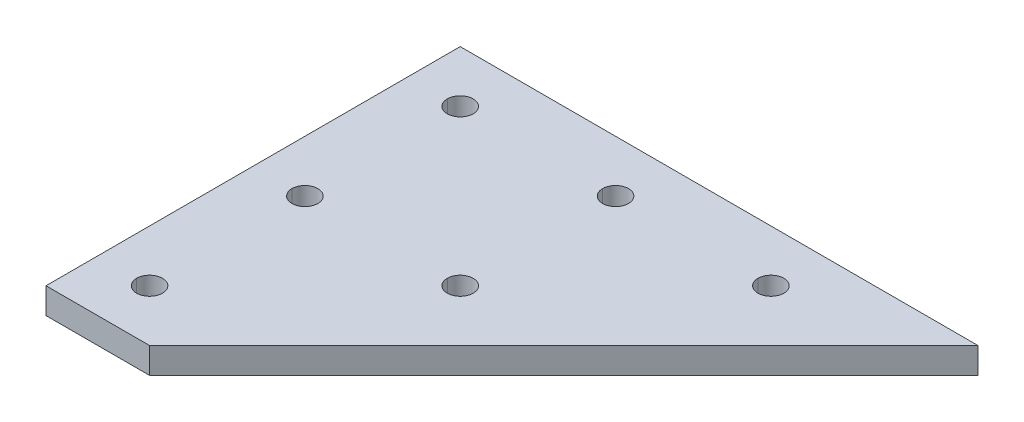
ISO-10303-21;
HEADER;
FILE_DESCRIPTION(('STEP AP214'),'2;1');
FILE_NAME('part.step','',(''),(''),'','','');
FILE_SCHEMA(('AUTOMOTIVE_DESIGN { 1 0 10303 214 1 1 1 1 }'));
ENDSEC;
DATA;
#1=APPLICATION_CONTEXT('core data for automotive mechanical design processes');
#2=APPLICATION_PROTOCOL_DEFINITION('international standard','automotive_design',2000,#1);
#3=PRODUCT_CONTEXT('',#1,'mechanical');
#4=PRODUCT('Part','Part','',(#3));
#5=PRODUCT_RELATED_PRODUCT_CATEGORY('part','',(#4));
#6=PRODUCT_DEFINITION_FORMATION('','',#4);
#7=PRODUCT_DEFINITION_CONTEXT('part definition',#1,'design');
#8=PRODUCT_DEFINITION('design','',#6,#7);
#9=PRODUCT_DEFINITION_SHAPE('','',#8);
#10=(LENGTH_UNIT() NAMED_UNIT(*) SI_UNIT(.MILLI.,.METRE.));
#11=(NAMED_UNIT(*) PLANE_ANGLE_UNIT() SI_UNIT($,.RADIAN.));
#12=(NAMED_UNIT(*) SI_UNIT($,.STERADIAN.) SOLID_ANGLE_UNIT());
#13=UNCERTAINTY_MEASURE_WITH_UNIT(LENGTH_MEASURE(1.E-05),#10,'distance_accuracy_value','');
#14=(GEOMETRIC_REPRESENTATION_CONTEXT(3) GLOBAL_UNCERTAINTY_ASSIGNED_CONTEXT((#13)) GLOBAL_UNIT_ASSIGNED_CONTEXT((#10,
#11,#12)) REPRESENTATION_CONTEXT('',''));
#15=CARTESIAN_POINT('',(0.,0.,0.));
#16=DIRECTION('',(0.,0.,1.));
#17=DIRECTION('',(1.,0.,0.));
#18=AXIS2_PLACEMENT_3D('',#15,#16,#17);
#19=CARTESIAN_POINT('',(-101.6,6.35000000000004,0.));
#20=DIRECTION('',(0.,-1.,0.));
#21=DIRECTION('',(0.,0.,-1.));
#22=AXIS2_PLACEMENT_3D('',#19,#20,#21);
#23=PLANE('',#22);
#24=DIRECTION('',(0.,0.,-1.));
#25=VECTOR('',#24,1.);
#26=CARTESIAN_POINT('',(-127.,6.35000000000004,0.));
#27=LINE('',#26,#25);
#28=CARTESIAN_POINT('',(-127.,6.35000000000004,-101.6));
#29=VERTEX_POINT('',#28);
#30=CARTESIAN_POINT('',(-127.,6.35000000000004,101.6));
#31=VERTEX_POINT('',#30);
#32=EDGE_CURVE('E183',#29,#31,#27,.F.);
#33=ORIENTED_EDGE('',*,*,#32,.T.);
#34=DIRECTION('',(1.,0.,0.));
#35=VECTOR('',#34,1.);
#36=CARTESIAN_POINT('',(-101.6,6.35000000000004,101.6));
#37=LINE('',#36,#35);
#38=CARTESIAN_POINT('',(-76.2,6.35000000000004,101.6));
#39=VERTEX_POINT('',#38);
#40=EDGE_CURVE('E238',#39,#31,#37,.F.);
#41=ORIENTED_EDGE('',*,*,#40,.F.);
#42=DIRECTION('',(-0.707106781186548,0.,0.707106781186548));
#43=VECTOR('',#42,1.);
#44=CARTESIAN_POINT('',(127.,6.35000000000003,-101.6));
#45=LINE('',#44,#43);
#46=CARTESIAN_POINT('',(127.,6.35000000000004,-101.6));
#47=VERTEX_POINT('',#46);
#48=EDGE_CURVE('E243',#39,#47,#45,.F.);
#49=ORIENTED_EDGE('',*,*,#48,.T.);
#50=DIRECTION('',(1.,0.,0.));
#51=VECTOR('',#50,1.);
#52=CARTESIAN_POINT('',(-101.6,6.35000000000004,-101.6));
#53=LINE('',#52,#51);
#54=EDGE_CURVE('E248',#47,#29,#53,.F.);
#55=ORIENTED_EDGE('',*,*,#54,.T.);
#56=EDGE_LOOP('',(#33,#41,#49,#55));
#57=FACE_BOUND('',#56,.T.);
#58=CARTESIAN_POINT('',(-101.6,6.35000000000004,76.2));
#59=DIRECTION('',(0.,-1.,0.));
#60=DIRECTION('',(0.,0.,-1.));
#61=AXIS2_PLACEMENT_3D('',#58,#59,#60);
#62=CIRCLE('',#61,6.35);
#63=CARTESIAN_POINT('',(-95.25,6.35000000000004,76.2));
#64=VERTEX_POINT('',#63);
#65=CARTESIAN_POINT('',(-107.95,6.35000000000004,76.2));
#66=VERTEX_POINT('',#65);
#67=EDGE_CURVE('E189',#64,#66,#62,.T.);
#68=ORIENTED_EDGE('',*,*,#67,.T.);
#69=CARTESIAN_POINT('',(-101.6,6.35000000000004,76.2));
#70=DIRECTION('',(0.,-1.,0.));
#71=DIRECTION('',(0.,0.,-1.));
#72=AXIS2_PLACEMENT_3D('',#69,#70,#71);
#73=CIRCLE('',#72,6.35);
#74=EDGE_CURVE('E184',#66,#64,#73,.T.);
#75=ORIENTED_EDGE('',*,*,#74,.T.);
#76=EDGE_LOOP('',(#68,#75));
#77=FACE_BOUND('',#76,.T.);
#78=CARTESIAN_POINT('',(-101.6,6.35000000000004,0.));
#79=DIRECTION('',(0.,-1.,0.));
#80=DIRECTION('',(0.,0.,-1.));
#81=AXIS2_PLACEMENT_3D('',#78,#79,#80);
#82=CIRCLE('',#81,6.35);
#83=CARTESIAN_POINT('',(-95.25,6.35000000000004,0.));
#84=VERTEX_POINT('',#83);
#85=CARTESIAN_POINT('',(-107.95,6.35000000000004,0.));
#86=VERTEX_POINT('',#85);
#87=EDGE_CURVE('E196',#84,#86,#82,.T.);
#88=ORIENTED_EDGE('',*,*,#87,.T.);
#89=CARTESIAN_POINT('',(-101.6,6.35000000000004,0.));
#90=DIRECTION('',(0.,-1.,0.));
#91=DIRECTION('',(0.,0.,-1.));
#92=AXIS2_PLACEMENT_3D('',#89,#90,#91);
#93=CIRCLE('',#92,6.35);
#94=EDGE_CURVE('E192',#86,#84,#93,.T.);
#95=ORIENTED_EDGE('',*,*,#94,.T.);
#96=EDGE_LOOP('',(#88,#95));
#97=FACE_BOUND('',#96,.T.);
#98=CARTESIAN_POINT('',(-101.6,6.35000000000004,-76.2));
#99=DIRECTION('',(0.,-1.,0.));
#100=DIRECTION('',(0.,0.,-1.));
#101=AXIS2_PLACEMENT_3D('',#98,#99,#100);
#102=CIRCLE('',#101,6.35);
#103=CARTESIAN_POINT('',(-95.25,6.35000000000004,-76.2));
#104=VERTEX_POINT('',#103);
#105=CARTESIAN_POINT('',(-107.95,6.35000000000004,-76.1999999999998));
#106=VERTEX_POINT('',#105);
#107=EDGE_CURVE('E203',#104,#106,#102,.T.);
#108=ORIENTED_EDGE('',*,*,#107,.T.);
#109=CARTESIAN_POINT('',(-101.6,6.35000000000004,-76.2));
#110=DIRECTION('',(0.,-1.,0.));
#111=DIRECTION('',(0.,0.,-1.));
#112=AXIS2_PLACEMENT_3D('',#109,#110,#111);
#113=CIRCLE('',#112,6.35);
#114=EDGE_CURVE('E199',#106,#104,#113,.T.);
#115=ORIENTED_EDGE('',*,*,#114,.T.);
#116=EDGE_LOOP('',(#108,#115));
#117=FACE_BOUND('',#116,.T.);
#118=CARTESIAN_POINT('',(50.8,6.35000000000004,-76.2));
#119=DIRECTION('',(0.,-1.,0.));
#120=DIRECTION('',(0.,0.,-1.));
#121=AXIS2_PLACEMENT_3D('',#118,#119,#120);
#122=CIRCLE('',#121,6.34999999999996);
#123=CARTESIAN_POINT('',(57.15,6.35000000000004,-76.2));
#124=VERTEX_POINT('',#123);
#125=CARTESIAN_POINT('',(44.45,6.35000000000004,-76.1999999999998));
#126=VERTEX_POINT('',#125);
#127=EDGE_CURVE('E210',#124,#126,#122,.T.);
#128=ORIENTED_EDGE('',*,*,#127,.T.);
#129=CARTESIAN_POINT('',(50.8,6.35000000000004,-76.2));
#130=DIRECTION('',(0.,-1.,0.));
#131=DIRECTION('',(0.,0.,-1.));
#132=AXIS2_PLACEMENT_3D('',#129,#130,#131);
#133=CIRCLE('',#132,6.34999999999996);
#134=EDGE_CURVE('E206',#126,#124,#133,.T.);
#135=ORIENTED_EDGE('',*,*,#134,.T.);
#136=EDGE_LOOP('',(#128,#135));
#137=FACE_BOUND('',#136,.T.);
#138=CARTESIAN_POINT('',(-25.4,6.35000000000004,-76.2));
#139=DIRECTION('',(0.,1.,0.));
#140=DIRECTION('',(0.,0.,1.));
#141=AXIS2_PLACEMENT_3D('',#138,#139,#140);
#142=CIRCLE('',#141,6.35);
#143=CARTESIAN_POINT('',(-31.75,6.35000000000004,-76.2));
#144=VERTEX_POINT('',#143);
#145=CARTESIAN_POINT('',(-19.05,6.35000000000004,-76.2));
#146=VERTEX_POINT('',#145);
#147=EDGE_CURVE('E144',#144,#146,#142,.F.);
#148=ORIENTED_EDGE('',*,*,#147,.T.);
#149=CARTESIAN_POINT('',(-25.4,6.35000000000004,-76.2));
#150=DIRECTION('',(0.,1.,0.));
#151=DIRECTION('',(0.,0.,1.));
#152=AXIS2_PLACEMENT_3D('',#149,#150,#151);
#153=CIRCLE('',#152,6.35);
#154=EDGE_CURVE('E141',#146,#144,#153,.F.);
#155=ORIENTED_EDGE('',*,*,#154,.T.);
#156=EDGE_LOOP('',(#148,#155));
#157=FACE_BOUND('',#156,.T.);
#158=CARTESIAN_POINT('',(-25.4,6.35000000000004,0.));
#159=DIRECTION('',(0.,1.,0.));
#160=DIRECTION('',(0.,0.,1.));
#161=AXIS2_PLACEMENT_3D('',#158,#159,#160);
#162=CIRCLE('',#161,6.35);
#163=CARTESIAN_POINT('',(-31.75,6.35000000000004,0.));
#164=VERTEX_POINT('',#163);
#165=CARTESIAN_POINT('',(-19.05,6.35000000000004,0.));
#166=VERTEX_POINT('',#165);
#167=EDGE_CURVE('E131',#164,#166,#162,.F.);
#168=ORIENTED_EDGE('',*,*,#167,.T.);
#169=CARTESIAN_POINT('',(-25.4,6.35000000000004,0.));
#170=DIRECTION('',(0.,1.,0.));
#171=DIRECTION('',(0.,0.,1.));
#172=AXIS2_PLACEMENT_3D('',#169,#170,#171);
#173=CIRCLE('',#172,6.35);
#174=EDGE_CURVE('E19',#166,#164,#173,.F.);
#175=ORIENTED_EDGE('',*,*,#174,.T.);
#176=EDGE_LOOP('',(#168,#175));
#177=FACE_BOUND('',#176,.T.);
#178=ADVANCED_FACE('F16',(#57,#77,#97,#117,#137,#157,#177),#23,.F.);
#179=CARTESIAN_POINT('',(-25.4,0.,0.));
#180=DIRECTION('',(0.,1.,0.));
#181=DIRECTION('',(0.,0.,1.));
#182=AXIS2_PLACEMENT_3D('',#179,#180,#181);
#183=CYLINDRICAL_SURFACE('',#182,6.35);
#184=ORIENTED_EDGE('',*,*,#174,.F.);
#185=DIRECTION('',(0.,1.,0.));
#186=VECTOR('',#185,1.);
#187=CARTESIAN_POINT('',(-19.05,0.,0.));
#188=LINE('',#187,#186);
#189=CARTESIAN_POINT('',(-19.05,-6.35000000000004,0.));
#190=VERTEX_POINT('',#189);
#191=EDGE_CURVE('E136',#166,#190,#188,.F.);
#192=ORIENTED_EDGE('',*,*,#191,.T.);
#193=CARTESIAN_POINT('',(-25.4,-6.35000000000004,0.));
#194=DIRECTION('',(0.,1.,0.));
#195=DIRECTION('',(0.,0.,1.));
#196=AXIS2_PLACEMENT_3D('',#193,#194,#195);
#197=CIRCLE('',#196,6.35);
#198=CARTESIAN_POINT('',(-31.75,-6.35000000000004,0.));
#199=VERTEX_POINT('',#198);
#200=EDGE_CURVE('E140',#190,#199,#197,.F.);
#201=ORIENTED_EDGE('',*,*,#200,.T.);
#202=DIRECTION('',(0.,1.,0.));
#203=VECTOR('',#202,1.);
#204=CARTESIAN_POINT('',(-31.75,0.,0.));
#205=LINE('',#204,#203);
#206=EDGE_CURVE('E134',#199,#164,#205,.T.);
#207=ORIENTED_EDGE('',*,*,#206,.T.);
#208=EDGE_LOOP('',(#184,#192,#201,#207));
#209=FACE_BOUND('',#208,.T.);
#210=ADVANCED_FACE('F139',(#209),#183,.F.);
#211=CARTESIAN_POINT('',(-25.4,0.,0.));
#212=DIRECTION('',(0.,1.,0.));
#213=DIRECTION('',(0.,0.,1.));
#214=AXIS2_PLACEMENT_3D('',#211,#212,#213);
#215=CYLINDRICAL_SURFACE('',#214,6.35);
#216=CARTESIAN_POINT('',(-25.4,-6.35000000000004,0.));
#217=DIRECTION('',(0.,1.,0.));
#218=DIRECTION('',(0.,0.,1.));
#219=AXIS2_PLACEMENT_3D('',#216,#217,#218);
#220=CIRCLE('',#219,6.35);
#221=EDGE_CURVE('E180',#199,#190,#220,.F.);
#222=ORIENTED_EDGE('',*,*,#221,.T.);
#223=ORIENTED_EDGE('',*,*,#191,.F.);
#224=ORIENTED_EDGE('',*,*,#167,.F.);
#225=ORIENTED_EDGE('',*,*,#206,.F.);
#226=EDGE_LOOP('',(#222,#223,#224,#225));
#227=FACE_BOUND('',#226,.T.);
#228=ADVANCED_FACE('F133',(#227),#215,.F.);
#229=CARTESIAN_POINT('',(-25.4,0.,-76.2));
#230=DIRECTION('',(0.,1.,0.));
#231=DIRECTION('',(0.,0.,1.));
#232=AXIS2_PLACEMENT_3D('',#229,#230,#231);
#233=CYLINDRICAL_SURFACE('',#232,6.35);
#234=ORIENTED_EDGE('',*,*,#154,.F.);
#235=DIRECTION('',(0.,1.,0.));
#236=VECTOR('',#235,1.);
#237=CARTESIAN_POINT('',(-19.05,0.,-76.2));
#238=LINE('',#237,#236);
#239=CARTESIAN_POINT('',(-19.05,-6.35000000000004,-76.2));
#240=VERTEX_POINT('',#239);
#241=EDGE_CURVE('E214',#146,#240,#238,.F.);
#242=ORIENTED_EDGE('',*,*,#241,.T.);
#243=CARTESIAN_POINT('',(-25.4,-6.35000000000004,-76.2));
#244=DIRECTION('',(0.,1.,0.));
#245=DIRECTION('',(0.,0.,1.));
#246=AXIS2_PLACEMENT_3D('',#243,#244,#245);
#247=CIRCLE('',#246,6.35);
#248=CARTESIAN_POINT('',(-31.75,-6.35000000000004,-76.2));
#249=VERTEX_POINT('',#248);
#250=EDGE_CURVE('E177',#240,#249,#247,.F.);
#251=ORIENTED_EDGE('',*,*,#250,.T.);
#252=DIRECTION('',(0.,1.,0.));
#253=VECTOR('',#252,1.);
#254=CARTESIAN_POINT('',(-31.75,0.,-76.2));
#255=LINE('',#254,#253);
#256=EDGE_CURVE('E212',#249,#144,#255,.T.);
#257=ORIENTED_EDGE('',*,*,#256,.T.);
#258=EDGE_LOOP('',(#234,#242,#251,#257));
#259=FACE_BOUND('',#258,.T.);
#260=ADVANCED_FACE('F329',(#259),#233,.F.);
#261=CARTESIAN_POINT('',(-25.4,0.,-76.2));
#262=DIRECTION('',(0.,1.,0.));
#263=DIRECTION('',(0.,0.,1.));
#264=AXIS2_PLACEMENT_3D('',#261,#262,#263);
#265=CYLINDRICAL_SURFACE('',#264,6.35);
#266=CARTESIAN_POINT('',(-25.4,-6.35000000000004,-76.2));
#267=DIRECTION('',(0.,1.,0.));
#268=DIRECTION('',(0.,0.,1.));
#269=AXIS2_PLACEMENT_3D('',#266,#267,#268);
#270=CIRCLE('',#269,6.35);
#271=EDGE_CURVE('E174',#249,#240,#270,.F.);
#272=ORIENTED_EDGE('',*,*,#271,.T.);
#273=ORIENTED_EDGE('',*,*,#241,.F.);
#274=ORIENTED_EDGE('',*,*,#147,.F.);
#275=ORIENTED_EDGE('',*,*,#256,.F.);
#276=EDGE_LOOP('',(#272,#273,#274,#275));
#277=FACE_BOUND('',#276,.T.);
#278=ADVANCED_FACE('F325',(#277),#265,.F.);
#279=CARTESIAN_POINT('',(50.8,31.75,-76.2));
#280=DIRECTION('',(0.,-1.,0.));
#281=DIRECTION('',(0.,0.,-1.));
#282=AXIS2_PLACEMENT_3D('',#279,#280,#281);
#283=CYLINDRICAL_SURFACE('',#282,6.34999999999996);
#284=CARTESIAN_POINT('',(50.8,-6.35000000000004,-76.2));
#285=DIRECTION('',(0.,-1.,0.));
#286=DIRECTION('',(0.,0.,-1.));
#287=AXIS2_PLACEMENT_3D('',#284,#285,#286);
#288=CIRCLE('',#287,6.34999999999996);
#289=CARTESIAN_POINT('',(57.15,-6.35000000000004,-76.2));
#290=VERTEX_POINT('',#289);
#291=CARTESIAN_POINT('',(44.45,-6.35000000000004,-76.2));
#292=VERTEX_POINT('',#291);
#293=EDGE_CURVE('E171',#290,#292,#288,.T.);
#294=ORIENTED_EDGE('',*,*,#293,.T.);
#295=DIRECTION('',(0.,-1.,0.));
#296=VECTOR('',#295,1.);
#297=CARTESIAN_POINT('',(44.45,31.75,-76.2));
#298=LINE('',#297,#296);
#299=EDGE_CURVE('E209',#292,#126,#298,.F.);
#300=ORIENTED_EDGE('',*,*,#299,.T.);
#301=ORIENTED_EDGE('',*,*,#127,.F.);
#302=DIRECTION('',(0.,-1.,0.));
#303=VECTOR('',#302,1.);
#304=CARTESIAN_POINT('',(57.15,31.75,-76.2));
#305=LINE('',#304,#303);
#306=EDGE_CURVE('E205',#124,#290,#305,.T.);
#307=ORIENTED_EDGE('',*,*,#306,.T.);
#308=EDGE_LOOP('',(#294,#300,#301,#307));
#309=FACE_BOUND('',#308,.T.);
#310=ADVANCED_FACE('F321',(#309),#283,.F.);
#311=CARTESIAN_POINT('',(50.8,31.75,-76.2));
#312=DIRECTION('',(0.,-1.,0.));
#313=DIRECTION('',(0.,0.,-1.));
#314=AXIS2_PLACEMENT_3D('',#311,#312,#313);
#315=CYLINDRICAL_SURFACE('',#314,6.34999999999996);
#316=ORIENTED_EDGE('',*,*,#134,.F.);
#317=ORIENTED_EDGE('',*,*,#299,.F.);
#318=CARTESIAN_POINT('',(50.8,-6.35000000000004,-76.2));
#319=DIRECTION('',(0.,-1.,0.));
#320=DIRECTION('',(0.,0.,-1.));
#321=AXIS2_PLACEMENT_3D('',#318,#319,#320);
#322=CIRCLE('',#321,6.34999999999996);
#323=EDGE_CURVE('E168',#292,#290,#322,.T.);
#324=ORIENTED_EDGE('',*,*,#323,.T.);
#325=ORIENTED_EDGE('',*,*,#306,.F.);
#326=EDGE_LOOP('',(#316,#317,#324,#325));
#327=FACE_BOUND('',#326,.T.);
#328=ADVANCED_FACE('F317',(#327),#315,.F.);
#329=CARTESIAN_POINT('',(-101.6,6.35000000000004,-76.2));
#330=DIRECTION('',(0.,-1.,0.));
#331=DIRECTION('',(0.,0.,-1.));
#332=AXIS2_PLACEMENT_3D('',#329,#330,#331);
#333=CYLINDRICAL_SURFACE('',#332,6.35);
#334=CARTESIAN_POINT('',(-101.6,-6.35000000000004,-76.2));
#335=DIRECTION('',(0.,-1.,0.));
#336=DIRECTION('',(0.,0.,-1.));
#337=AXIS2_PLACEMENT_3D('',#334,#335,#336);
#338=CIRCLE('',#337,6.35);
#339=CARTESIAN_POINT('',(-95.25,-6.35000000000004,-76.2));
#340=VERTEX_POINT('',#339);
#341=CARTESIAN_POINT('',(-107.95,-6.35000000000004,-76.2));
#342=VERTEX_POINT('',#341);
#343=EDGE_CURVE('E165',#340,#342,#338,.T.);
#344=ORIENTED_EDGE('',*,*,#343,.T.);
#345=DIRECTION('',(0.,-1.,0.));
#346=VECTOR('',#345,1.);
#347=CARTESIAN_POINT('',(-107.95,6.35000000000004,-76.2));
#348=LINE('',#347,#346);
#349=EDGE_CURVE('E202',#342,#106,#348,.F.);
#350=ORIENTED_EDGE('',*,*,#349,.T.);
#351=ORIENTED_EDGE('',*,*,#107,.F.);
#352=DIRECTION('',(0.,-1.,0.));
#353=VECTOR('',#352,1.);
#354=CARTESIAN_POINT('',(-95.25,6.35000000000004,-76.2));
#355=LINE('',#354,#353);
#356=EDGE_CURVE('E198',#104,#340,#355,.T.);
#357=ORIENTED_EDGE('',*,*,#356,.T.);
#358=EDGE_LOOP('',(#344,#350,#351,#357));
#359=FACE_BOUND('',#358,.T.);
#360=ADVANCED_FACE('F313',(#359),#333,.F.);
#361=CARTESIAN_POINT('',(-101.6,6.35000000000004,-76.2));
#362=DIRECTION('',(0.,-1.,0.));
#363=DIRECTION('',(0.,0.,-1.));
#364=AXIS2_PLACEMENT_3D('',#361,#362,#363);
#365=CYLINDRICAL_SURFACE('',#364,6.35);
#366=ORIENTED_EDGE('',*,*,#114,.F.);
#367=ORIENTED_EDGE('',*,*,#349,.F.);
#368=CARTESIAN_POINT('',(-101.6,-6.35000000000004,-76.2));
#369=DIRECTION('',(0.,-1.,0.));
#370=DIRECTION('',(0.,0.,-1.));
#371=AXIS2_PLACEMENT_3D('',#368,#369,#370);
#372=CIRCLE('',#371,6.35);
#373=EDGE_CURVE('E162',#342,#340,#372,.T.);
#374=ORIENTED_EDGE('',*,*,#373,.T.);
#375=ORIENTED_EDGE('',*,*,#356,.F.);
#376=EDGE_LOOP('',(#366,#367,#374,#375));
#377=FACE_BOUND('',#376,.T.);
#378=ADVANCED_FACE('F309',(#377),#365,.F.);
#379=CARTESIAN_POINT('',(-101.6,6.35000000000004,0.));
#380=DIRECTION('',(0.,-1.,0.));
#381=DIRECTION('',(0.,0.,-1.));
#382=AXIS2_PLACEMENT_3D('',#379,#380,#381);
#383=CYLINDRICAL_SURFACE('',#382,6.35);
#384=CARTESIAN_POINT('',(-101.6,-6.35000000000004,0.));
#385=DIRECTION('',(0.,-1.,0.));
#386=DIRECTION('',(0.,0.,-1.));
#387=AXIS2_PLACEMENT_3D('',#384,#385,#386);
#388=CIRCLE('',#387,6.35);
#389=CARTESIAN_POINT('',(-95.25,-6.35000000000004,0.));
#390=VERTEX_POINT('',#389);
#391=CARTESIAN_POINT('',(-107.95,-6.35000000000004,0.));
#392=VERTEX_POINT('',#391);
#393=EDGE_CURVE('E159',#390,#392,#388,.T.);
#394=ORIENTED_EDGE('',*,*,#393,.T.);
#395=DIRECTION('',(0.,-1.,0.));
#396=VECTOR('',#395,1.);
#397=CARTESIAN_POINT('',(-107.95,6.35000000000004,0.));
#398=LINE('',#397,#396);
#399=EDGE_CURVE('E195',#392,#86,#398,.F.);
#400=ORIENTED_EDGE('',*,*,#399,.T.);
#401=ORIENTED_EDGE('',*,*,#87,.F.);
#402=DIRECTION('',(0.,-1.,0.));
#403=VECTOR('',#402,1.);
#404=CARTESIAN_POINT('',(-95.25,6.35000000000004,0.));
#405=LINE('',#404,#403);
#406=EDGE_CURVE('E191',#84,#390,#405,.T.);
#407=ORIENTED_EDGE('',*,*,#406,.T.);
#408=EDGE_LOOP('',(#394,#400,#401,#407));
#409=FACE_BOUND('',#408,.T.);
#410=ADVANCED_FACE('F305',(#409),#383,.F.);
#411=CARTESIAN_POINT('',(-101.6,6.35000000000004,0.));
#412=DIRECTION('',(0.,-1.,0.));
#413=DIRECTION('',(0.,0.,-1.));
#414=AXIS2_PLACEMENT_3D('',#411,#412,#413);
#415=CYLINDRICAL_SURFACE('',#414,6.35);
#416=ORIENTED_EDGE('',*,*,#94,.F.);
#417=ORIENTED_EDGE('',*,*,#399,.F.);
#418=CARTESIAN_POINT('',(-101.6,-6.35000000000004,0.));
#419=DIRECTION('',(0.,-1.,0.));
#420=DIRECTION('',(0.,0.,-1.));
#421=AXIS2_PLACEMENT_3D('',#418,#419,#420);
#422=CIRCLE('',#421,6.35);
#423=EDGE_CURVE('E156',#392,#390,#422,.T.);
#424=ORIENTED_EDGE('',*,*,#423,.T.);
#425=ORIENTED_EDGE('',*,*,#406,.F.);
#426=EDGE_LOOP('',(#416,#417,#424,#425));
#427=FACE_BOUND('',#426,.T.);
#428=ADVANCED_FACE('F301',(#427),#415,.F.);
#429=CARTESIAN_POINT('',(-101.6,6.35000000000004,76.2));
#430=DIRECTION('',(0.,-1.,0.));
#431=DIRECTION('',(0.,0.,-1.));
#432=AXIS2_PLACEMENT_3D('',#429,#430,#431);
#433=CYLINDRICAL_SURFACE('',#432,6.35);
#434=CARTESIAN_POINT('',(-101.6,-6.35000000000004,76.2));
#435=DIRECTION('',(0.,-1.,0.));
#436=DIRECTION('',(0.,0.,-1.));
#437=AXIS2_PLACEMENT_3D('',#434,#435,#436);
#438=CIRCLE('',#437,6.35);
#439=CARTESIAN_POINT('',(-95.25,-6.35000000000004,76.2));
#440=VERTEX_POINT('',#439);
#441=CARTESIAN_POINT('',(-107.95,-6.35000000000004,76.2));
#442=VERTEX_POINT('',#441);
#443=EDGE_CURVE('E153',#440,#442,#438,.T.);
#444=ORIENTED_EDGE('',*,*,#443,.T.);
#445=DIRECTION('',(0.,-1.,0.));
#446=VECTOR('',#445,1.);
#447=CARTESIAN_POINT('',(-107.95,6.35000000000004,76.2));
#448=LINE('',#447,#446);
#449=EDGE_CURVE('E188',#442,#66,#448,.F.);
#450=ORIENTED_EDGE('',*,*,#449,.T.);
#451=ORIENTED_EDGE('',*,*,#67,.F.);
#452=DIRECTION('',(0.,-1.,0.));
#453=VECTOR('',#452,1.);
#454=CARTESIAN_POINT('',(-95.25,6.35000000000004,76.2));
#455=LINE('',#454,#453);
#456=EDGE_CURVE('E187',#64,#440,#455,.T.);
#457=ORIENTED_EDGE('',*,*,#456,.T.);
#458=EDGE_LOOP('',(#444,#450,#451,#457));
#459=FACE_BOUND('',#458,.T.);
#460=ADVANCED_FACE('F297',(#459),#433,.F.);
#461=CARTESIAN_POINT('',(-101.6,6.35000000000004,76.2));
#462=DIRECTION('',(0.,-1.,0.));
#463=DIRECTION('',(0.,0.,-1.));
#464=AXIS2_PLACEMENT_3D('',#461,#462,#463);
#465=CYLINDRICAL_SURFACE('',#464,6.35);
#466=ORIENTED_EDGE('',*,*,#74,.F.);
#467=ORIENTED_EDGE('',*,*,#449,.F.);
#468=CARTESIAN_POINT('',(-101.6,-6.35000000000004,76.2));
#469=DIRECTION('',(0.,-1.,0.));
#470=DIRECTION('',(0.,0.,-1.));
#471=AXIS2_PLACEMENT_3D('',#468,#469,#470);
#472=CIRCLE('',#471,6.35);
#473=EDGE_CURVE('E149',#442,#440,#472,.T.);
#474=ORIENTED_EDGE('',*,*,#473,.T.);
#475=ORIENTED_EDGE('',*,*,#456,.F.);
#476=EDGE_LOOP('',(#466,#467,#474,#475));
#477=FACE_BOUND('',#476,.T.);
#478=ADVANCED_FACE('F294',(#477),#465,.F.);
#479=CARTESIAN_POINT('',(-101.6,0.,101.6));
#480=DIRECTION('',(0.,0.,1.));
#481=DIRECTION('',(1.,0.,0.));
#482=AXIS2_PLACEMENT_3D('',#479,#480,#481);
#483=PLANE('',#482);
#484=DIRECTION('',(0.,1.,0.));
#485=VECTOR('',#484,1.);
#486=CARTESIAN_POINT('',(-127.,0.,101.6));
#487=LINE('',#486,#485);
#488=CARTESIAN_POINT('',(-127.,-6.35000000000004,101.6));
#489=VERTEX_POINT('',#488);
#490=EDGE_CURVE('E251',#31,#489,#487,.F.);
#491=ORIENTED_EDGE('',*,*,#490,.T.);
#492=DIRECTION('',(1.,0.,0.));
#493=VECTOR('',#492,1.);
#494=CARTESIAN_POINT('',(-101.6,-6.35000000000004,101.6));
#495=LINE('',#494,#493);
#496=CARTESIAN_POINT('',(-76.2,-6.35000000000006,101.6));
#497=VERTEX_POINT('',#496);
#498=EDGE_CURVE('E152',#489,#497,#495,.T.);
#499=ORIENTED_EDGE('',*,*,#498,.T.);
#500=DIRECTION('',(0.,1.,0.));
#501=VECTOR('',#500,1.);
#502=CARTESIAN_POINT('',(-76.2,44.45,101.6));
#503=LINE('',#502,#501);
#504=EDGE_CURVE('E240',#497,#39,#503,.T.);
#505=ORIENTED_EDGE('',*,*,#504,.T.);
#506=ORIENTED_EDGE('',*,*,#40,.T.);
#507=EDGE_LOOP('',(#491,#499,#505,#506));
#508=FACE_BOUND('',#507,.T.);
#509=ADVANCED_FACE('F277',(#508),#483,.T.);
#510=CARTESIAN_POINT('',(127.,44.45,-101.6));
#511=DIRECTION('',(-0.707106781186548,0.,-0.707106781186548));
#512=DIRECTION('',(-0.707106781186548,0.,0.707106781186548));
#513=AXIS2_PLACEMENT_3D('',#510,#511,#512);
#514=PLANE('',#513);
#515=ORIENTED_EDGE('',*,*,#504,.F.);
#516=DIRECTION('',(0.707106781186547,0.,-0.707106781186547));
#517=VECTOR('',#516,1.);
#518=CARTESIAN_POINT('',(-76.2,-6.35000000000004,101.6));
#519=LINE('',#518,#517);
#520=CARTESIAN_POINT('',(127.,-6.35000000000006,-101.6));
#521=VERTEX_POINT('',#520);
#522=EDGE_CURVE('E259',#497,#521,#519,.T.);
#523=ORIENTED_EDGE('',*,*,#522,.T.);
#524=DIRECTION('',(0.,1.,0.));
#525=VECTOR('',#524,1.);
#526=CARTESIAN_POINT('',(127.,0.,-101.6));
#527=LINE('',#526,#525);
#528=EDGE_CURVE('E245',#521,#47,#527,.T.);
#529=ORIENTED_EDGE('',*,*,#528,.T.);
#530=ORIENTED_EDGE('',*,*,#48,.F.);
#531=EDGE_LOOP('',(#515,#523,#529,#530));
#532=FACE_BOUND('',#531,.T.);
#533=ADVANCED_FACE('F274',(#532),#514,.F.);
#534=CARTESIAN_POINT('',(-101.6,0.,-101.6));
#535=DIRECTION('',(0.,0.,1.));
#536=DIRECTION('',(1.,0.,0.));
#537=AXIS2_PLACEMENT_3D('',#534,#535,#536);
#538=PLANE('',#537);
#539=DIRECTION('',(0.,1.,0.));
#540=VECTOR('',#539,1.);
#541=CARTESIAN_POINT('',(-127.,0.,-101.6));
#542=LINE('',#541,#540);
#543=CARTESIAN_POINT('',(-127.,-6.35000000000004,-101.6));
#544=VERTEX_POINT('',#543);
#545=EDGE_CURVE('E33',#544,#29,#542,.T.);
#546=ORIENTED_EDGE('',*,*,#545,.T.);
#547=ORIENTED_EDGE('',*,*,#54,.F.);
#548=ORIENTED_EDGE('',*,*,#528,.F.);
#549=DIRECTION('',(1.,0.,0.));
#550=VECTOR('',#549,1.);
#551=CARTESIAN_POINT('',(-101.6,-6.35000000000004,-101.6));
#552=LINE('',#551,#550);
#553=EDGE_CURVE('E25',#521,#544,#552,.F.);
#554=ORIENTED_EDGE('',*,*,#553,.T.);
#555=EDGE_LOOP('',(#546,#547,#548,#554));
#556=FACE_BOUND('',#555,.T.);
#557=ADVANCED_FACE('F267',(#556),#538,.F.);
#558=CARTESIAN_POINT('',(-127.,0.,0.));
#559=DIRECTION('',(1.,0.,0.));
#560=DIRECTION('',(0.,0.,-1.));
#561=AXIS2_PLACEMENT_3D('',#558,#559,#560);
#562=PLANE('',#561);
#563=ORIENTED_EDGE('',*,*,#545,.F.);
#564=DIRECTION('',(0.,0.,1.));
#565=VECTOR('',#564,1.);
#566=CARTESIAN_POINT('',(-127.,-6.35000000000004,0.));
#567=LINE('',#566,#565);
#568=EDGE_CURVE('E11',#544,#489,#567,.T.);
#569=ORIENTED_EDGE('',*,*,#568,.T.);
#570=ORIENTED_EDGE('',*,*,#490,.F.);
#571=ORIENTED_EDGE('',*,*,#32,.F.);
#572=EDGE_LOOP('',(#563,#569,#570,#571));
#573=FACE_BOUND('',#572,.T.);
#574=ADVANCED_FACE('F279',(#573),#562,.F.);
#575=CARTESIAN_POINT('',(-101.6,-6.35000000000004,0.));
#576=DIRECTION('',(0.,1.,0.));
#577=DIRECTION('',(0.,0.,1.));
#578=AXIS2_PLACEMENT_3D('',#575,#576,#577);
#579=PLANE('',#578);
#580=ORIENTED_EDGE('',*,*,#553,.F.);
#581=ORIENTED_EDGE('',*,*,#522,.F.);
#582=ORIENTED_EDGE('',*,*,#498,.F.);
#583=ORIENTED_EDGE('',*,*,#568,.F.);
#584=EDGE_LOOP('',(#580,#581,#582,#583));
#585=FACE_BOUND('',#584,.T.);
#586=ORIENTED_EDGE('',*,*,#443,.F.);
#587=ORIENTED_EDGE('',*,*,#473,.F.);
#588=EDGE_LOOP('',(#586,#587));
#589=FACE_BOUND('',#588,.T.);
#590=ORIENTED_EDGE('',*,*,#393,.F.);
#591=ORIENTED_EDGE('',*,*,#423,.F.);
#592=EDGE_LOOP('',(#590,#591));
#593=FACE_BOUND('',#592,.T.);
#594=ORIENTED_EDGE('',*,*,#343,.F.);
#595=ORIENTED_EDGE('',*,*,#373,.F.);
#596=EDGE_LOOP('',(#594,#595));
#597=FACE_BOUND('',#596,.T.);
#598=ORIENTED_EDGE('',*,*,#293,.F.);
#599=ORIENTED_EDGE('',*,*,#323,.F.);
#600=EDGE_LOOP('',(#598,#599));
#601=FACE_BOUND('',#600,.T.);
#602=ORIENTED_EDGE('',*,*,#250,.F.);
#603=ORIENTED_EDGE('',*,*,#271,.F.);
#604=EDGE_LOOP('',(#602,#603));
#605=FACE_BOUND('',#604,.T.);
#606=ORIENTED_EDGE('',*,*,#200,.F.);
#607=ORIENTED_EDGE('',*,*,#221,.F.);
#608=EDGE_LOOP('',(#606,#607));
#609=FACE_BOUND('',#608,.T.);
#610=ADVANCED_FACE('F271',(#585,#589,#593,#597,#601,#605,#609),#579,.F.);
#611=CLOSED_SHELL('',(#178,#210,#228,#260,#278,#310,#328,#360,#378,#410,#428,#460,#478,#509,
#533,#557,#574,#610));
#612=MANIFOLD_SOLID_BREP('B1',#611);
#613=ADVANCED_BREP_SHAPE_REPRESENTATION('',(#18,#612),#14);
#614=SHAPE_DEFINITION_REPRESENTATION(#9,#613);
ENDSEC;
END-ISO-10303-21;
